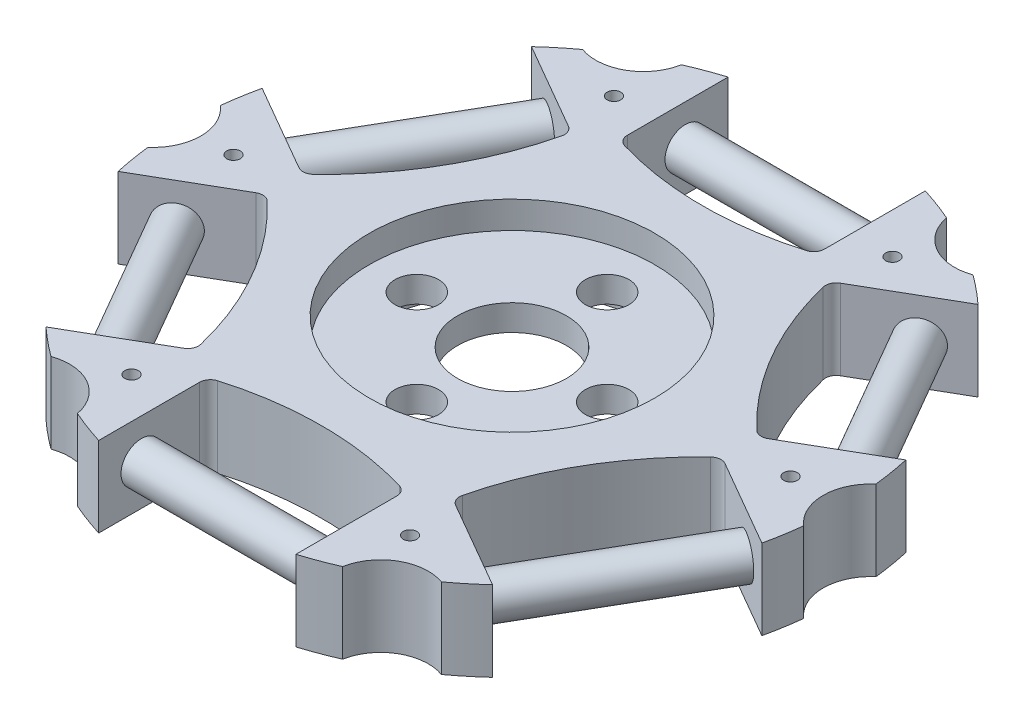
from build123d import *

# Parameters (mm, degrees)
SKETCH_1_W                  = 24.25
SKETCH_1_H                  = 5.9
CUT_EXTRUDE_1_DEPTH         = 35.798491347
CUT_EXTRUDE_2_DEPTH         = 35.798491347
CUT_EXTRUDE_3_DEPTH         = 35.798491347
CUT_EXTRUDE_4_DEPTH         = 35.798491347
CUT_EXTRUDE_5_DEPTH         = 35.798491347
CUT_EXTRUDE_6_DEPTH         = 35.798491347
CUT_EXTRUDE_7_DEPTH         = 35.798491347
CUT_EXTRUDE_8_DEPTH         = 35.034871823
CUT_EXTRUDE_9_DEPTH         = 35.034871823
CUT_EXTRUDE_10_DEPTH        = 35.034871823
CUT_EXTRUDE_11_DEPTH        = 34.930864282
CUT_EXTRUDE_12_DEPTH        = 34.930864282
SKETCH_15_W                 = 14.5
SKETCH_15_H                 = 1.5
HOLE_WIZARD_3_2_3_2_1_D     = 3.2
HOLE_WIZARD_3_2_3_2_1_DEPTH = 3.9
FILLET_1_R                  = 0.8
SKETCH_23_R                 = 0.5
CUT_EXTRUDE_13_DEPTH        = 10
PATTERN_CIRCULAR_1_COUNT    = 6
PATTERN_CIRCULAR_2_COUNT    = 6


with BuildPart() as part:
    # Sketch 1 → Revolve 1 (revolve)
    with BuildSketch(Plane(origin=(0, 0, 0), x_dir=(-1, 0, 0), z_dir=(0, 0, -1)), mode=Mode.PRIVATE) as revolve_1_sk:
        with Locations((-12.125, -0.05)):
            Rectangle(SKETCH_1_W, SKETCH_1_H)
    revolve(revolve_1_sk.sketch.rotate(Axis((0, -3, 0), (0, 1, 0)), 270), axis=Axis((0, -3, 0), (0, 1, 0)))

    # Sketch 2 → Cut-Extrude 1 (cut, through all)
    with BuildSketch(Plane(origin=(0, 2.9, 0), x_dir=(-1, 0, 0), z_dir=(0, 1, 0))):
        with BuildLine():
            Line((-7.25, 23.140872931), (-7.25, 15.140872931))
            ThreePointArc((-7.25, 15.140872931), (0, 14), (7.25, 15.140872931))
            Line((7.25, 15.140872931), (7.25, 23.140872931))
            ThreePointArc((7.25, 23.140872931), (0, 24.25), (-7.25, 23.140872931))
        make_face()
    extrude(amount=-CUT_EXTRUDE_1_DEPTH, mode=Mode.SUBTRACT)

    # Sketch 3 → Cut-Extrude 2 (cut, through all)
    with BuildSketch(Plane(origin=(0, 2.9, 0), x_dir=(-1, 0, 0), z_dir=(0, 1, 0))):
        with BuildLine():
            ThreePointArc((14.354448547, 19.545135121), (12.125, 21.001116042), (9.749359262, 22.20388466))
            ThreePointArc((9.749359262, 22.20388466), (11.44, 19.814661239), (14.354448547, 19.545135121))
        make_face()
    extrude(amount=-CUT_EXTRUDE_2_DEPTH, mode=Mode.SUBTRACT)

    # Sketch 4 → Cut-Extrude 3 (cut, through all)
    with BuildSketch(Plane(origin=(0, 2.9, 0), x_dir=(-1, 0, 0), z_dir=(0, 1, 0))):
        with BuildLine():
            Line((16.415583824, 17.849120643), (9.487380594, 13.849120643))
            ThreePointArc((9.487380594, 13.849120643), (12.124355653, 7), (16.737380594, 1.291752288))
            Line((16.737380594, 1.291752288), (23.665583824, 5.291752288))
            ThreePointArc((23.665583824, 5.291752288), (21.001116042, 12.125), (16.415583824, 17.849120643))
        make_face()
    extrude(amount=-CUT_EXTRUDE_3_DEPTH, mode=Mode.SUBTRACT)

    # Sketch 5 → Cut-Extrude 4 (cut, through all)
    with BuildSketch(Plane(origin=(0, 2.9, 0), x_dir=(-1, 0, 0), z_dir=(0, 1, 0))):
        with BuildLine():
            ThreePointArc((24.103807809, -2.658749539), (24.25, 0), (24.103807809, 2.658749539))
            ThreePointArc((24.103807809, 2.658749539), (22.88, 0), (24.103807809, -2.658749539))
        make_face()
    extrude(amount=-CUT_EXTRUDE_4_DEPTH, mode=Mode.SUBTRACT)

    # Sketch 6 → Cut-Extrude 5 (cut, through all)
    with BuildSketch(Plane(origin=(0, 2.9, 0), x_dir=(-1, 0, 0), z_dir=(0, 1, 0))):
        with BuildLine():
            Line((23.665583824, -5.291752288), (16.737380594, -1.291752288))
            ThreePointArc((16.737380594, -1.291752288), (12.124355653, -7), (9.487380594, -13.849120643))
            Line((9.487380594, -13.849120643), (16.415583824, -17.849120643))
            ThreePointArc((16.415583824, -17.849120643), (21.001116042, -12.125), (23.665583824, -5.291752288))
        make_face()
    extrude(amount=-CUT_EXTRUDE_5_DEPTH, mode=Mode.SUBTRACT)

    # Sketch 7 → Cut-Extrude 6 (cut, through all)
    with BuildSketch(Plane(origin=(0, 2.9, 0), x_dir=(-1, 0, 0), z_dir=(0, 1, 0))):
        with BuildLine():
            ThreePointArc((9.749359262, -22.20388466), (12.125, -21.001116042), (14.354448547, -19.545135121))
            ThreePointArc((14.354448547, -19.545135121), (11.44, -19.814661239), (9.749359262, -22.20388466))
        make_face()
    extrude(amount=-CUT_EXTRUDE_6_DEPTH, mode=Mode.SUBTRACT)

    # Sketch 8 → Cut-Extrude 7 (cut, through all)
    with BuildSketch(Plane(origin=(0, 2.9, 0), x_dir=(-1, 0, 0), z_dir=(0, 1, 0))):
        with BuildLine():
            Line((7.25, -23.140872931), (7.25, -15.140872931))
            ThreePointArc((7.25, -15.140872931), (0, -14), (-7.25, -15.140872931))
            Line((-7.25, -15.140872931), (-7.25, -23.140872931))
            ThreePointArc((-7.25, -23.140872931), (0, -24.25), (7.25, -23.140872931))
        make_face()
    extrude(amount=-CUT_EXTRUDE_7_DEPTH, mode=Mode.SUBTRACT)

    # Sketch 9 → Cut-Extrude 8 (cut, through all)
    with BuildSketch(Plane(origin=(0, 2.9, 0), x_dir=(-1, 0, 0), z_dir=(0, 1, 0))):
        with BuildLine():
            ThreePointArc((-14.354448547, -19.545135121), (-12.125, -21.001116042), (-9.749359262, -22.20388466))
            ThreePointArc((-9.749359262, -22.20388466), (-11.44, -19.814661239), (-14.354448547, -19.545135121))
        make_face()
    extrude(amount=-CUT_EXTRUDE_8_DEPTH, mode=Mode.SUBTRACT)

    # Sketch 10 → Cut-Extrude 9 (cut, through all)
    with BuildSketch(Plane(origin=(0, 2.9, 0), x_dir=(-1, 0, 0), z_dir=(0, 1, 0))):
        with BuildLine():
            Line((-16.415583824, -17.849120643), (-9.487380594, -13.849120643))
            ThreePointArc((-9.487380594, -13.849120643), (-12.124355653, -7), (-16.737380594, -1.291752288))
            Line((-16.737380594, -1.291752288), (-23.665583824, -5.291752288))
            ThreePointArc((-23.665583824, -5.291752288), (-21.001116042, -12.125), (-16.415583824, -17.849120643))
        make_face()
    extrude(amount=-CUT_EXTRUDE_9_DEPTH, mode=Mode.SUBTRACT)

    # Sketch 11 → Cut-Extrude 10 (cut, through all)
    with BuildSketch(Plane(origin=(0, 2.9, 0), x_dir=(-1, 0, 0), z_dir=(0, 1, 0))):
        with BuildLine():
            ThreePointArc((-24.103807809, 2.658749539), (-24.25, 0), (-24.103807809, -2.658749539))
            ThreePointArc((-24.103807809, -2.658749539), (-22.88, 0), (-24.103807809, 2.658749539))
        make_face()
    extrude(amount=-CUT_EXTRUDE_10_DEPTH, mode=Mode.SUBTRACT)

    # Sketch 12 → Cut-Extrude 11 (cut, through all)
    with BuildSketch(Plane(origin=(0, 2.9, 0), x_dir=(-1, 0, 0), z_dir=(0, 1, 0))):
        with BuildLine():
            Line((-23.665583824, 5.291752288), (-16.737380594, 1.291752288))
            ThreePointArc((-16.737380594, 1.291752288), (-12.124355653, 7), (-9.487380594, 13.849120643))
            Line((-9.487380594, 13.849120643), (-16.415583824, 17.849120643))
            ThreePointArc((-16.415583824, 17.849120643), (-21.001116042, 12.125), (-23.665583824, 5.291752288))
        make_face()
    extrude(amount=-CUT_EXTRUDE_11_DEPTH, mode=Mode.SUBTRACT)

    # Sketch 13 → Cut-Extrude 12 (cut, through all)
    with BuildSketch(Plane(origin=(0, 2.9, 0), x_dir=(-1, 0, 0), z_dir=(0, 1, 0))):
        with BuildLine():
            ThreePointArc((-9.749359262, 22.20388466), (-12.125, 21.001116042), (-14.354448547, 19.545135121))
            ThreePointArc((-14.354448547, 19.545135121), (-11.44, 19.814661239), (-9.749359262, 22.20388466))
        make_face()
    extrude(amount=-CUT_EXTRUDE_12_DEPTH, mode=Mode.SUBTRACT)

    # Sketch 14 → Cut-Revolve 1 (revolve, cut)
    with BuildSketch(Plane.XY):
        Polygon((10.5, 2.9), (0, 2.9), (0, -3), (10.5, -3), (10.5, -1), (4, -1), (4, 0.9), (10.5, 0.9), align=None)
    revolve(axis=Axis((0, 2.9, 0), (0, -1, 0)), mode=Mode.SUBTRACT)

    # Sketch 15 → Revolve 2 (revolve)
    with BuildSketch(Plane(origin=(0, 0, 20), x_dir=(-1, 0, 0), z_dir=(0, 0, -1)), mode=Mode.PRIVATE) as revolve_2_sk:
        with Locations((0, 0.7)):
            Rectangle(SKETCH_15_W, SKETCH_15_H)
    revolve_2 = revolve(revolve_2_sk.sketch.rotate(Axis((7.25, -0.05, 20), (-1, 0, 0)), 270), axis=Axis((7.25, -0.05, 20), (-1, 0, 0)))

    # Hole Wizard 3.2 _3.2_ _1
    with Locations(Plane(origin=(0, -1, 0), x_dir=(-1, 0, 0), z_dir=(0, -1, 0))):
        with Locations((0, 7), (0, -7), (-7, 0), (7, 0)):
            Hole(HOLE_WIZARD_3_2_3_2_1_D / 2, depth=HOLE_WIZARD_3_2_3_2_1_DEPTH)

    # Fillet 1
    fillet_1_edges = [part.edges().sort_by_distance(p)[0] for p in [
        (16.737380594, -0.05, -1.291752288),
        (9.487380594, -0.05, -13.849120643),
        (-7.25, -0.05, 15.140872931),
        (7.25, -0.05, 15.140872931),
        (9.487380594, -0.05, 13.849120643),
        (16.737380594, -0.05, 1.291752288),
        (-16.737380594, -0.05, 1.291752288),
        (-9.487380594, -0.05, 13.849120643),
        (-9.487380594, -0.05, -13.849120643),
        (-16.737380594, -0.05, -1.291752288),
        (7.25, -0.05, -15.140872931),
        (-7.25, -0.05, -15.140872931),
    ]]
    fillet(fillet_1_edges, radius=FILLET_1_R)

    # Sketch 23 → Cut-Extrude 13 (cut)
    with BuildSketch(Plane.XZ.offset(3)):
        with Locations(Location((20.48, 0, 0), (0, 0, 270))):
            Circle(SKETCH_23_R)
    cut_extrude_13 = extrude(amount=-CUT_EXTRUDE_13_DEPTH, mode=Mode.SUBTRACT)

    # Pattern Circular 1: Cut-Extrude 13 ×6 about axis
    pattern_circular_1_axis = Axis((0, 0, 0), (0, 1, 0))
    for i in range(1, PATTERN_CIRCULAR_1_COUNT):
        add(cut_extrude_13.rotate(pattern_circular_1_axis, i * 360 / PATTERN_CIRCULAR_1_COUNT), mode=Mode.SUBTRACT)

    # Pattern Circular 2: Revolve 2 ×6 about axis
    pattern_circular_2_axis = Axis((0, 2.9, 0), (0, -1, 0))
    for i in range(1, PATTERN_CIRCULAR_2_COUNT):
        add(revolve_2.rotate(pattern_circular_2_axis, i * 360 / PATTERN_CIRCULAR_2_COUNT))


solid = part.part
